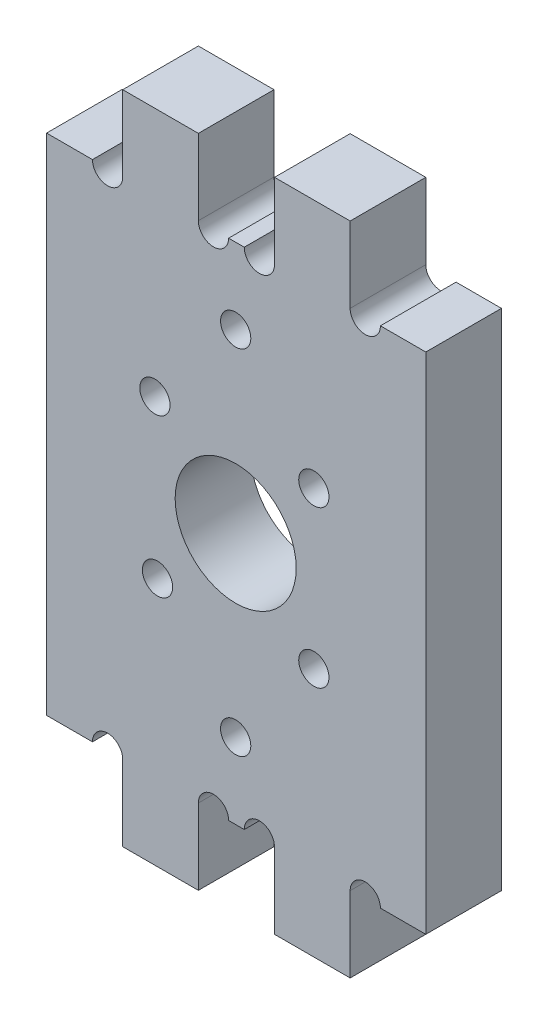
ISO-10303-21;
HEADER;
FILE_DESCRIPTION(('STEP AP214'),'2;1');
FILE_NAME('part.step','',(''),(''),'','','');
FILE_SCHEMA(('AUTOMOTIVE_DESIGN { 1 0 10303 214 1 1 1 1 }'));
ENDSEC;
DATA;
#1=APPLICATION_CONTEXT('core data for automotive mechanical design processes');
#2=APPLICATION_PROTOCOL_DEFINITION('international standard','automotive_design',2000,#1);
#3=PRODUCT_CONTEXT('',#1,'mechanical');
#4=PRODUCT('Part','Part','',(#3));
#5=PRODUCT_RELATED_PRODUCT_CATEGORY('part','',(#4));
#6=PRODUCT_DEFINITION_FORMATION('','',#4);
#7=PRODUCT_DEFINITION_CONTEXT('part definition',#1,'design');
#8=PRODUCT_DEFINITION('design','',#6,#7);
#9=PRODUCT_DEFINITION_SHAPE('','',#8);
#10=(LENGTH_UNIT() NAMED_UNIT(*) SI_UNIT(.MILLI.,.METRE.));
#11=(NAMED_UNIT(*) PLANE_ANGLE_UNIT() SI_UNIT($,.RADIAN.));
#12=(NAMED_UNIT(*) SI_UNIT($,.STERADIAN.) SOLID_ANGLE_UNIT());
#13=UNCERTAINTY_MEASURE_WITH_UNIT(LENGTH_MEASURE(1.E-05),#10,'distance_accuracy_value','');
#14=(GEOMETRIC_REPRESENTATION_CONTEXT(3) GLOBAL_UNCERTAINTY_ASSIGNED_CONTEXT((#13)) GLOBAL_UNIT_ASSIGNED_CONTEXT((#10,
#11,#12)) REPRESENTATION_CONTEXT('',''));
#15=CARTESIAN_POINT('',(0.,0.,0.));
#16=DIRECTION('',(0.,0.,1.));
#17=DIRECTION('',(1.,0.,0.));
#18=AXIS2_PLACEMENT_3D('',#15,#16,#17);
#19=CARTESIAN_POINT('',(0.,0.,15.));
#20=DIRECTION('',(0.,1.,0.));
#21=DIRECTION('',(-1.,0.,0.));
#22=AXIS2_PLACEMENT_3D('',#19,#20,#21);
#23=PLANE('',#22);
#24=DIRECTION('',(1.,0.,0.));
#25=VECTOR('',#24,1.);
#26=CARTESIAN_POINT('',(0.,0.,0.));
#27=LINE('',#26,#25);
#28=CARTESIAN_POINT('',(-8.99999999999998,0.,0.));
#29=VERTEX_POINT('',#28);
#30=CARTESIAN_POINT('',(0.,0.,0.));
#31=VERTEX_POINT('',#30);
#32=EDGE_CURVE('E255',#29,#31,#27,.T.);
#33=ORIENTED_EDGE('',*,*,#32,.T.);
#34=DIRECTION('',(0.,0.,-1.));
#35=VECTOR('',#34,1.);
#36=CARTESIAN_POINT('',(0.,0.,15.));
#37=LINE('',#36,#35);
#38=CARTESIAN_POINT('',(0.,0.,15.));
#39=VERTEX_POINT('',#38);
#40=EDGE_CURVE('E11',#39,#31,#37,.T.);
#41=ORIENTED_EDGE('',*,*,#40,.F.);
#42=DIRECTION('',(1.,0.,0.));
#43=VECTOR('',#42,1.);
#44=CARTESIAN_POINT('',(0.,0.,15.));
#45=LINE('',#44,#43);
#46=CARTESIAN_POINT('',(-8.99999999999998,0.,15.));
#47=VERTEX_POINT('',#46);
#48=EDGE_CURVE('E310',#47,#39,#45,.T.);
#49=ORIENTED_EDGE('',*,*,#48,.F.);
#50=DIRECTION('',(0.,0.,-1.));
#51=VECTOR('',#50,1.);
#52=CARTESIAN_POINT('',(-8.99999999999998,0.,15.));
#53=LINE('',#52,#51);
#54=EDGE_CURVE('E251',#47,#29,#53,.T.);
#55=ORIENTED_EDGE('',*,*,#54,.T.);
#56=EDGE_LOOP('',(#33,#41,#49,#55));
#57=FACE_BOUND('',#56,.T.);
#58=ADVANCED_FACE('F37',(#57),#23,.F.);
#59=CARTESIAN_POINT('',(0.,0.,15.));
#60=DIRECTION('',(-1.,0.,0.));
#61=DIRECTION('',(0.,0.,1.));
#62=AXIS2_PLACEMENT_3D('',#59,#60,#61);
#63=PLANE('',#62);
#64=DIRECTION('',(0.,1.,0.));
#65=VECTOR('',#64,1.);
#66=CARTESIAN_POINT('',(0.,0.,0.));
#67=LINE('',#66,#65);
#68=CARTESIAN_POINT('',(0.,100.,0.));
#69=VERTEX_POINT('',#68);
#70=EDGE_CURVE('E258',#31,#69,#67,.T.);
#71=ORIENTED_EDGE('',*,*,#70,.T.);
#72=DIRECTION('',(0.,0.,-1.));
#73=VECTOR('',#72,1.);
#74=CARTESIAN_POINT('',(0.,100.,15.));
#75=LINE('',#74,#73);
#76=CARTESIAN_POINT('',(0.,100.,15.));
#77=VERTEX_POINT('',#76);
#78=EDGE_CURVE('E46',#77,#69,#75,.T.);
#79=ORIENTED_EDGE('',*,*,#78,.F.);
#80=DIRECTION('',(0.,1.,0.));
#81=VECTOR('',#80,1.);
#82=CARTESIAN_POINT('',(0.,0.,15.));
#83=LINE('',#82,#81);
#84=EDGE_CURVE('E158',#39,#77,#83,.T.);
#85=ORIENTED_EDGE('',*,*,#84,.F.);
#86=ORIENTED_EDGE('',*,*,#40,.T.);
#87=EDGE_LOOP('',(#71,#79,#85,#86));
#88=FACE_BOUND('',#87,.T.);
#89=ADVANCED_FACE('F510',(#88),#63,.F.);
#90=CARTESIAN_POINT('',(0.,100.,15.));
#91=DIRECTION('',(0.,-1.,0.));
#92=DIRECTION('',(0.,0.,-1.));
#93=AXIS2_PLACEMENT_3D('',#90,#91,#92);
#94=PLANE('',#93);
#95=DIRECTION('',(-1.,0.,0.));
#96=VECTOR('',#95,1.);
#97=CARTESIAN_POINT('',(0.,100.,0.));
#98=LINE('',#97,#96);
#99=CARTESIAN_POINT('',(-9.,100.,0.));
#100=VERTEX_POINT('',#99);
#101=EDGE_CURVE('E261',#69,#100,#98,.T.);
#102=ORIENTED_EDGE('',*,*,#101,.T.);
#103=DIRECTION('',(0.,0.,-1.));
#104=VECTOR('',#103,1.);
#105=CARTESIAN_POINT('',(-9.,100.,15.));
#106=LINE('',#105,#104);
#107=CARTESIAN_POINT('',(-9.,100.,15.));
#108=VERTEX_POINT('',#107);
#109=EDGE_CURVE('E377',#108,#100,#106,.T.);
#110=ORIENTED_EDGE('',*,*,#109,.F.);
#111=DIRECTION('',(-1.,0.,0.));
#112=VECTOR('',#111,1.);
#113=CARTESIAN_POINT('',(0.,100.,15.));
#114=LINE('',#113,#112);
#115=EDGE_CURVE('E438',#77,#108,#114,.T.);
#116=ORIENTED_EDGE('',*,*,#115,.F.);
#117=ORIENTED_EDGE('',*,*,#78,.T.);
#118=EDGE_LOOP('',(#102,#110,#116,#117));
#119=FACE_BOUND('',#118,.T.);
#120=ADVANCED_FACE('F514',(#119),#94,.F.);
#121=CARTESIAN_POINT('',(-12.,100.,15.));
#122=DIRECTION('',(0.,0.,-1.));
#123=DIRECTION('',(-1.,0.,0.));
#124=AXIS2_PLACEMENT_3D('',#121,#122,#123);
#125=CYLINDRICAL_SURFACE('',#124,3.);
#126=CARTESIAN_POINT('',(-12.,100.,0.));
#127=DIRECTION('',(0.,0.,-1.));
#128=DIRECTION('',(-1.,0.,0.));
#129=AXIS2_PLACEMENT_3D('',#126,#127,#128);
#130=CIRCLE('',#129,3.);
#131=CARTESIAN_POINT('',(-15.,100.,0.));
#132=VERTEX_POINT('',#131);
#133=EDGE_CURVE('E263',#100,#132,#130,.T.);
#134=ORIENTED_EDGE('',*,*,#133,.T.);
#135=DIRECTION('',(0.,0.,-1.));
#136=VECTOR('',#135,1.);
#137=CARTESIAN_POINT('',(-15.,100.,15.));
#138=LINE('',#137,#136);
#139=CARTESIAN_POINT('',(-15.,100.,15.));
#140=VERTEX_POINT('',#139);
#141=EDGE_CURVE('E374',#140,#132,#138,.T.);
#142=ORIENTED_EDGE('',*,*,#141,.F.);
#143=CARTESIAN_POINT('',(-12.,100.,15.));
#144=DIRECTION('',(0.,0.,-1.));
#145=DIRECTION('',(-1.,0.,0.));
#146=AXIS2_PLACEMENT_3D('',#143,#144,#145);
#147=CIRCLE('',#146,3.);
#148=EDGE_CURVE('E440',#108,#140,#147,.T.);
#149=ORIENTED_EDGE('',*,*,#148,.F.);
#150=ORIENTED_EDGE('',*,*,#109,.T.);
#151=EDGE_LOOP('',(#134,#142,#149,#150));
#152=FACE_BOUND('',#151,.T.);
#153=ADVANCED_FACE('F518',(#152),#125,.F.);
#154=CARTESIAN_POINT('',(-15.,100.,15.));
#155=DIRECTION('',(-1.,0.,0.));
#156=DIRECTION('',(0.,-1.,0.));
#157=AXIS2_PLACEMENT_3D('',#154,#155,#156);
#158=PLANE('',#157);
#159=DIRECTION('',(0.,1.,0.));
#160=VECTOR('',#159,1.);
#161=CARTESIAN_POINT('',(-15.,100.,0.));
#162=LINE('',#161,#160);
#163=CARTESIAN_POINT('',(-15.,115.,0.));
#164=VERTEX_POINT('',#163);
#165=EDGE_CURVE('E265',#132,#164,#162,.T.);
#166=ORIENTED_EDGE('',*,*,#165,.T.);
#167=DIRECTION('',(0.,0.,-1.));
#168=VECTOR('',#167,1.);
#169=CARTESIAN_POINT('',(-15.,115.,15.));
#170=LINE('',#169,#168);
#171=CARTESIAN_POINT('',(-15.,115.,15.));
#172=VERTEX_POINT('',#171);
#173=EDGE_CURVE('E371',#172,#164,#170,.T.);
#174=ORIENTED_EDGE('',*,*,#173,.F.);
#175=DIRECTION('',(0.,1.,0.));
#176=VECTOR('',#175,1.);
#177=CARTESIAN_POINT('',(-15.,100.,15.));
#178=LINE('',#177,#176);
#179=EDGE_CURVE('E442',#140,#172,#178,.T.);
#180=ORIENTED_EDGE('',*,*,#179,.F.);
#181=ORIENTED_EDGE('',*,*,#141,.T.);
#182=EDGE_LOOP('',(#166,#174,#180,#181));
#183=FACE_BOUND('',#182,.T.);
#184=ADVANCED_FACE('F524',(#183),#158,.F.);
#185=CARTESIAN_POINT('',(-15.,115.,15.));
#186=DIRECTION('',(0.,-1.,0.));
#187=DIRECTION('',(0.,0.,-1.));
#188=AXIS2_PLACEMENT_3D('',#185,#186,#187);
#189=PLANE('',#188);
#190=DIRECTION('',(-1.,0.,0.));
#191=VECTOR('',#190,1.);
#192=CARTESIAN_POINT('',(-15.,115.,0.));
#193=LINE('',#192,#191);
#194=CARTESIAN_POINT('',(-30.,115.,0.));
#195=VERTEX_POINT('',#194);
#196=EDGE_CURVE('E267',#164,#195,#193,.T.);
#197=ORIENTED_EDGE('',*,*,#196,.T.);
#198=DIRECTION('',(0.,0.,-1.));
#199=VECTOR('',#198,1.);
#200=CARTESIAN_POINT('',(-30.,115.,15.));
#201=LINE('',#200,#199);
#202=CARTESIAN_POINT('',(-30.,115.,15.));
#203=VERTEX_POINT('',#202);
#204=EDGE_CURVE('E368',#203,#195,#201,.T.);
#205=ORIENTED_EDGE('',*,*,#204,.F.);
#206=DIRECTION('',(-1.,0.,0.));
#207=VECTOR('',#206,1.);
#208=CARTESIAN_POINT('',(-15.,115.,15.));
#209=LINE('',#208,#207);
#210=EDGE_CURVE('E444',#172,#203,#209,.T.);
#211=ORIENTED_EDGE('',*,*,#210,.F.);
#212=ORIENTED_EDGE('',*,*,#173,.T.);
#213=EDGE_LOOP('',(#197,#205,#211,#212));
#214=FACE_BOUND('',#213,.T.);
#215=ADVANCED_FACE('F528',(#214),#189,.F.);
#216=CARTESIAN_POINT('',(-30.,115.,15.));
#217=DIRECTION('',(1.,0.,0.));
#218=DIRECTION('',(0.,1.,0.));
#219=AXIS2_PLACEMENT_3D('',#216,#217,#218);
#220=PLANE('',#219);
#221=DIRECTION('',(0.,-1.,0.));
#222=VECTOR('',#221,1.);
#223=CARTESIAN_POINT('',(-30.,115.,0.));
#224=LINE('',#223,#222);
#225=CARTESIAN_POINT('',(-30.,100.,0.));
#226=VERTEX_POINT('',#225);
#227=EDGE_CURVE('E269',#195,#226,#224,.T.);
#228=ORIENTED_EDGE('',*,*,#227,.T.);
#229=DIRECTION('',(0.,0.,-1.));
#230=VECTOR('',#229,1.);
#231=CARTESIAN_POINT('',(-30.,100.,15.));
#232=LINE('',#231,#230);
#233=CARTESIAN_POINT('',(-30.,100.,15.));
#234=VERTEX_POINT('',#233);
#235=EDGE_CURVE('E365',#234,#226,#232,.T.);
#236=ORIENTED_EDGE('',*,*,#235,.F.);
#237=DIRECTION('',(0.,-1.,0.));
#238=VECTOR('',#237,1.);
#239=CARTESIAN_POINT('',(-30.,115.,15.));
#240=LINE('',#239,#238);
#241=EDGE_CURVE('E446',#203,#234,#240,.T.);
#242=ORIENTED_EDGE('',*,*,#241,.F.);
#243=ORIENTED_EDGE('',*,*,#204,.T.);
#244=EDGE_LOOP('',(#228,#236,#242,#243));
#245=FACE_BOUND('',#244,.T.);
#246=ADVANCED_FACE('F532',(#245),#220,.F.);
#247=CARTESIAN_POINT('',(-33.,100.,15.));
#248=DIRECTION('',(0.,0.,-1.));
#249=DIRECTION('',(-1.,0.,0.));
#250=AXIS2_PLACEMENT_3D('',#247,#248,#249);
#251=CYLINDRICAL_SURFACE('',#250,3.);
#252=CARTESIAN_POINT('',(-33.,100.,0.));
#253=DIRECTION('',(0.,0.,-1.));
#254=DIRECTION('',(-1.,0.,0.));
#255=AXIS2_PLACEMENT_3D('',#252,#253,#254);
#256=CIRCLE('',#255,3.);
#257=CARTESIAN_POINT('',(-36.,100.,0.));
#258=VERTEX_POINT('',#257);
#259=EDGE_CURVE('E271',#226,#258,#256,.T.);
#260=ORIENTED_EDGE('',*,*,#259,.T.);
#261=DIRECTION('',(0.,0.,-1.));
#262=VECTOR('',#261,1.);
#263=CARTESIAN_POINT('',(-36.,100.,15.));
#264=LINE('',#263,#262);
#265=CARTESIAN_POINT('',(-36.,100.,15.));
#266=VERTEX_POINT('',#265);
#267=EDGE_CURVE('E362',#266,#258,#264,.T.);
#268=ORIENTED_EDGE('',*,*,#267,.F.);
#269=CARTESIAN_POINT('',(-33.,100.,15.));
#270=DIRECTION('',(0.,0.,-1.));
#271=DIRECTION('',(-1.,0.,0.));
#272=AXIS2_PLACEMENT_3D('',#269,#270,#271);
#273=CIRCLE('',#272,3.);
#274=EDGE_CURVE('E448',#234,#266,#273,.T.);
#275=ORIENTED_EDGE('',*,*,#274,.F.);
#276=ORIENTED_EDGE('',*,*,#235,.T.);
#277=EDGE_LOOP('',(#260,#268,#275,#276));
#278=FACE_BOUND('',#277,.T.);
#279=ADVANCED_FACE('F536',(#278),#251,.F.);
#280=CARTESIAN_POINT('',(-36.,100.,15.));
#281=DIRECTION('',(0.,-1.,0.));
#282=DIRECTION('',(0.,0.,-1.));
#283=AXIS2_PLACEMENT_3D('',#280,#281,#282);
#284=PLANE('',#283);
#285=DIRECTION('',(-1.,0.,0.));
#286=VECTOR('',#285,1.);
#287=CARTESIAN_POINT('',(-36.,100.,0.));
#288=LINE('',#287,#286);
#289=CARTESIAN_POINT('',(-39.1,100.,0.));
#290=VERTEX_POINT('',#289);
#291=EDGE_CURVE('E273',#258,#290,#288,.T.);
#292=ORIENTED_EDGE('',*,*,#291,.T.);
#293=DIRECTION('',(0.,0.,-1.));
#294=VECTOR('',#293,1.);
#295=CARTESIAN_POINT('',(-39.1,100.,15.));
#296=LINE('',#295,#294);
#297=CARTESIAN_POINT('',(-39.1,100.,15.));
#298=VERTEX_POINT('',#297);
#299=EDGE_CURVE('E359',#298,#290,#296,.T.);
#300=ORIENTED_EDGE('',*,*,#299,.F.);
#301=DIRECTION('',(-1.,0.,0.));
#302=VECTOR('',#301,1.);
#303=CARTESIAN_POINT('',(-36.,100.,15.));
#304=LINE('',#303,#302);
#305=EDGE_CURVE('E450',#266,#298,#304,.T.);
#306=ORIENTED_EDGE('',*,*,#305,.F.);
#307=ORIENTED_EDGE('',*,*,#267,.T.);
#308=EDGE_LOOP('',(#292,#300,#306,#307));
#309=FACE_BOUND('',#308,.T.);
#310=ADVANCED_FACE('F540',(#309),#284,.F.);
#311=CARTESIAN_POINT('',(-42.1,100.,15.));
#312=DIRECTION('',(0.,0.,-1.));
#313=DIRECTION('',(-1.,0.,0.));
#314=AXIS2_PLACEMENT_3D('',#311,#312,#313);
#315=CYLINDRICAL_SURFACE('',#314,2.99999999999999);
#316=CARTESIAN_POINT('',(-42.1,100.,0.));
#317=DIRECTION('',(0.,0.,-1.));
#318=DIRECTION('',(-1.,0.,0.));
#319=AXIS2_PLACEMENT_3D('',#316,#317,#318);
#320=CIRCLE('',#319,2.99999999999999);
#321=CARTESIAN_POINT('',(-45.1,100.,0.));
#322=VERTEX_POINT('',#321);
#323=EDGE_CURVE('E275',#290,#322,#320,.T.);
#324=ORIENTED_EDGE('',*,*,#323,.T.);
#325=DIRECTION('',(0.,0.,-1.));
#326=VECTOR('',#325,1.);
#327=CARTESIAN_POINT('',(-45.1,100.,15.));
#328=LINE('',#327,#326);
#329=CARTESIAN_POINT('',(-45.1,100.,15.));
#330=VERTEX_POINT('',#329);
#331=EDGE_CURVE('E356',#330,#322,#328,.T.);
#332=ORIENTED_EDGE('',*,*,#331,.F.);
#333=CARTESIAN_POINT('',(-42.1,100.,15.));
#334=DIRECTION('',(0.,0.,-1.));
#335=DIRECTION('',(-1.,0.,0.));
#336=AXIS2_PLACEMENT_3D('',#333,#334,#335);
#337=CIRCLE('',#336,2.99999999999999);
#338=EDGE_CURVE('E452',#298,#330,#337,.T.);
#339=ORIENTED_EDGE('',*,*,#338,.F.);
#340=ORIENTED_EDGE('',*,*,#299,.T.);
#341=EDGE_LOOP('',(#324,#332,#339,#340));
#342=FACE_BOUND('',#341,.T.);
#343=ADVANCED_FACE('F544',(#342),#315,.F.);
#344=CARTESIAN_POINT('',(-45.1,100.,15.));
#345=DIRECTION('',(-1.,0.,0.));
#346=DIRECTION('',(0.,-1.,0.));
#347=AXIS2_PLACEMENT_3D('',#344,#345,#346);
#348=PLANE('',#347);
#349=DIRECTION('',(0.,1.,0.));
#350=VECTOR('',#349,1.);
#351=CARTESIAN_POINT('',(-45.1,100.,0.));
#352=LINE('',#351,#350);
#353=CARTESIAN_POINT('',(-45.1,115.,0.));
#354=VERTEX_POINT('',#353);
#355=EDGE_CURVE('E277',#322,#354,#352,.T.);
#356=ORIENTED_EDGE('',*,*,#355,.T.);
#357=DIRECTION('',(0.,0.,-1.));
#358=VECTOR('',#357,1.);
#359=CARTESIAN_POINT('',(-45.1,115.,15.));
#360=LINE('',#359,#358);
#361=CARTESIAN_POINT('',(-45.1,115.,15.));
#362=VERTEX_POINT('',#361);
#363=EDGE_CURVE('E353',#362,#354,#360,.T.);
#364=ORIENTED_EDGE('',*,*,#363,.F.);
#365=DIRECTION('',(0.,1.,0.));
#366=VECTOR('',#365,1.);
#367=CARTESIAN_POINT('',(-45.1,100.,15.));
#368=LINE('',#367,#366);
#369=EDGE_CURVE('E454',#330,#362,#368,.T.);
#370=ORIENTED_EDGE('',*,*,#369,.F.);
#371=ORIENTED_EDGE('',*,*,#331,.T.);
#372=EDGE_LOOP('',(#356,#364,#370,#371));
#373=FACE_BOUND('',#372,.T.);
#374=ADVANCED_FACE('F548',(#373),#348,.F.);
#375=CARTESIAN_POINT('',(-45.1,115.,15.));
#376=DIRECTION('',(0.,-1.,0.));
#377=DIRECTION('',(0.,0.,-1.));
#378=AXIS2_PLACEMENT_3D('',#375,#376,#377);
#379=PLANE('',#378);
#380=DIRECTION('',(-1.,0.,0.));
#381=VECTOR('',#380,1.);
#382=CARTESIAN_POINT('',(-45.1,115.,0.));
#383=LINE('',#382,#381);
#384=CARTESIAN_POINT('',(-60.1,115.,0.));
#385=VERTEX_POINT('',#384);
#386=EDGE_CURVE('E279',#354,#385,#383,.T.);
#387=ORIENTED_EDGE('',*,*,#386,.T.);
#388=DIRECTION('',(0.,0.,-1.));
#389=VECTOR('',#388,1.);
#390=CARTESIAN_POINT('',(-60.1,115.,15.));
#391=LINE('',#390,#389);
#392=CARTESIAN_POINT('',(-60.1,115.,15.));
#393=VERTEX_POINT('',#392);
#394=EDGE_CURVE('E350',#393,#385,#391,.T.);
#395=ORIENTED_EDGE('',*,*,#394,.F.);
#396=DIRECTION('',(-1.,0.,0.));
#397=VECTOR('',#396,1.);
#398=CARTESIAN_POINT('',(-45.1,115.,15.));
#399=LINE('',#398,#397);
#400=EDGE_CURVE('E456',#362,#393,#399,.T.);
#401=ORIENTED_EDGE('',*,*,#400,.F.);
#402=ORIENTED_EDGE('',*,*,#363,.T.);
#403=EDGE_LOOP('',(#387,#395,#401,#402));
#404=FACE_BOUND('',#403,.T.);
#405=ADVANCED_FACE('F552',(#404),#379,.F.);
#406=CARTESIAN_POINT('',(-60.1,115.,15.));
#407=DIRECTION('',(1.,0.,0.));
#408=DIRECTION('',(0.,1.,0.));
#409=AXIS2_PLACEMENT_3D('',#406,#407,#408);
#410=PLANE('',#409);
#411=DIRECTION('',(0.,-1.,0.));
#412=VECTOR('',#411,1.);
#413=CARTESIAN_POINT('',(-60.1,115.,0.));
#414=LINE('',#413,#412);
#415=CARTESIAN_POINT('',(-60.1,100.,0.));
#416=VERTEX_POINT('',#415);
#417=EDGE_CURVE('E281',#385,#416,#414,.T.);
#418=ORIENTED_EDGE('',*,*,#417,.T.);
#419=DIRECTION('',(0.,0.,-1.));
#420=VECTOR('',#419,1.);
#421=CARTESIAN_POINT('',(-60.1,100.,15.));
#422=LINE('',#421,#420);
#423=CARTESIAN_POINT('',(-60.1,100.,15.));
#424=VERTEX_POINT('',#423);
#425=EDGE_CURVE('E347',#424,#416,#422,.T.);
#426=ORIENTED_EDGE('',*,*,#425,.F.);
#427=DIRECTION('',(0.,-1.,0.));
#428=VECTOR('',#427,1.);
#429=CARTESIAN_POINT('',(-60.1,115.,15.));
#430=LINE('',#429,#428);
#431=EDGE_CURVE('E458',#393,#424,#430,.T.);
#432=ORIENTED_EDGE('',*,*,#431,.F.);
#433=ORIENTED_EDGE('',*,*,#394,.T.);
#434=EDGE_LOOP('',(#418,#426,#432,#433));
#435=FACE_BOUND('',#434,.T.);
#436=ADVANCED_FACE('F556',(#435),#410,.F.);
#437=CARTESIAN_POINT('',(-63.1,100.,15.));
#438=DIRECTION('',(0.,0.,-1.));
#439=DIRECTION('',(-1.,0.,0.));
#440=AXIS2_PLACEMENT_3D('',#437,#438,#439);
#441=CYLINDRICAL_SURFACE('',#440,3.);
#442=CARTESIAN_POINT('',(-63.1,100.,0.));
#443=DIRECTION('',(0.,0.,-1.));
#444=DIRECTION('',(-1.,0.,0.));
#445=AXIS2_PLACEMENT_3D('',#442,#443,#444);
#446=CIRCLE('',#445,3.);
#447=CARTESIAN_POINT('',(-66.1,100.,0.));
#448=VERTEX_POINT('',#447);
#449=EDGE_CURVE('E283',#416,#448,#446,.T.);
#450=ORIENTED_EDGE('',*,*,#449,.T.);
#451=DIRECTION('',(0.,0.,-1.));
#452=VECTOR('',#451,1.);
#453=CARTESIAN_POINT('',(-66.1,100.,15.));
#454=LINE('',#453,#452);
#455=CARTESIAN_POINT('',(-66.1,100.,15.));
#456=VERTEX_POINT('',#455);
#457=EDGE_CURVE('E344',#456,#448,#454,.T.);
#458=ORIENTED_EDGE('',*,*,#457,.F.);
#459=CARTESIAN_POINT('',(-63.1,100.,15.));
#460=DIRECTION('',(0.,0.,-1.));
#461=DIRECTION('',(-1.,0.,0.));
#462=AXIS2_PLACEMENT_3D('',#459,#460,#461);
#463=CIRCLE('',#462,3.);
#464=EDGE_CURVE('E460',#424,#456,#463,.T.);
#465=ORIENTED_EDGE('',*,*,#464,.F.);
#466=ORIENTED_EDGE('',*,*,#425,.T.);
#467=EDGE_LOOP('',(#450,#458,#465,#466));
#468=FACE_BOUND('',#467,.T.);
#469=ADVANCED_FACE('F560',(#468),#441,.F.);
#470=CARTESIAN_POINT('',(-66.1,100.,15.));
#471=DIRECTION('',(0.,-1.,0.));
#472=DIRECTION('',(1.,0.,0.));
#473=AXIS2_PLACEMENT_3D('',#470,#471,#472);
#474=PLANE('',#473);
#475=DIRECTION('',(-1.,0.,0.));
#476=VECTOR('',#475,1.);
#477=CARTESIAN_POINT('',(-66.1,100.,0.));
#478=LINE('',#477,#476);
#479=CARTESIAN_POINT('',(-75.2,100.,0.));
#480=VERTEX_POINT('',#479);
#481=EDGE_CURVE('E285',#448,#480,#478,.T.);
#482=ORIENTED_EDGE('',*,*,#481,.T.);
#483=DIRECTION('',(0.,0.,-1.));
#484=VECTOR('',#483,1.);
#485=CARTESIAN_POINT('',(-75.2,100.,15.));
#486=LINE('',#485,#484);
#487=CARTESIAN_POINT('',(-75.2,100.,15.));
#488=VERTEX_POINT('',#487);
#489=EDGE_CURVE('E341',#488,#480,#486,.T.);
#490=ORIENTED_EDGE('',*,*,#489,.F.);
#491=DIRECTION('',(-1.,0.,0.));
#492=VECTOR('',#491,1.);
#493=CARTESIAN_POINT('',(-66.1,100.,15.));
#494=LINE('',#493,#492);
#495=EDGE_CURVE('E462',#456,#488,#494,.T.);
#496=ORIENTED_EDGE('',*,*,#495,.F.);
#497=ORIENTED_EDGE('',*,*,#457,.T.);
#498=EDGE_LOOP('',(#482,#490,#496,#497));
#499=FACE_BOUND('',#498,.T.);
#500=ADVANCED_FACE('F564',(#499),#474,.F.);
#501=CARTESIAN_POINT('',(-75.2,100.,15.));
#502=DIRECTION('',(1.,0.,0.));
#503=DIRECTION('',(0.,1.,0.));
#504=AXIS2_PLACEMENT_3D('',#501,#502,#503);
#505=PLANE('',#504);
#506=DIRECTION('',(0.,-1.,0.));
#507=VECTOR('',#506,1.);
#508=CARTESIAN_POINT('',(-75.2,100.,0.));
#509=LINE('',#508,#507);
#510=CARTESIAN_POINT('',(-75.2,0.,0.));
#511=VERTEX_POINT('',#510);
#512=EDGE_CURVE('E287',#480,#511,#509,.T.);
#513=ORIENTED_EDGE('',*,*,#512,.T.);
#514=DIRECTION('',(0.,0.,-1.));
#515=VECTOR('',#514,1.);
#516=CARTESIAN_POINT('',(-75.2,0.,15.));
#517=LINE('',#516,#515);
#518=CARTESIAN_POINT('',(-75.2,0.,15.));
#519=VERTEX_POINT('',#518);
#520=EDGE_CURVE('E338',#519,#511,#517,.T.);
#521=ORIENTED_EDGE('',*,*,#520,.F.);
#522=DIRECTION('',(0.,-1.,0.));
#523=VECTOR('',#522,1.);
#524=CARTESIAN_POINT('',(-75.2,100.,15.));
#525=LINE('',#524,#523);
#526=EDGE_CURVE('E464',#488,#519,#525,.T.);
#527=ORIENTED_EDGE('',*,*,#526,.F.);
#528=ORIENTED_EDGE('',*,*,#489,.T.);
#529=EDGE_LOOP('',(#513,#521,#527,#528));
#530=FACE_BOUND('',#529,.T.);
#531=ADVANCED_FACE('F568',(#530),#505,.F.);
#532=CARTESIAN_POINT('',(-75.2,0.,15.));
#533=DIRECTION('',(0.,1.,0.));
#534=DIRECTION('',(0.,0.,1.));
#535=AXIS2_PLACEMENT_3D('',#532,#533,#534);
#536=PLANE('',#535);
#537=DIRECTION('',(1.,0.,0.));
#538=VECTOR('',#537,1.);
#539=CARTESIAN_POINT('',(-75.2,0.,0.));
#540=LINE('',#539,#538);
#541=CARTESIAN_POINT('',(-66.1,0.,0.));
#542=VERTEX_POINT('',#541);
#543=EDGE_CURVE('E289',#511,#542,#540,.T.);
#544=ORIENTED_EDGE('',*,*,#543,.T.);
#545=DIRECTION('',(0.,0.,-1.));
#546=VECTOR('',#545,1.);
#547=CARTESIAN_POINT('',(-66.1,0.,15.));
#548=LINE('',#547,#546);
#549=CARTESIAN_POINT('',(-66.1,0.,15.));
#550=VERTEX_POINT('',#549);
#551=EDGE_CURVE('E335',#550,#542,#548,.T.);
#552=ORIENTED_EDGE('',*,*,#551,.F.);
#553=DIRECTION('',(1.,0.,0.));
#554=VECTOR('',#553,1.);
#555=CARTESIAN_POINT('',(-75.2,0.,15.));
#556=LINE('',#555,#554);
#557=EDGE_CURVE('E466',#519,#550,#556,.T.);
#558=ORIENTED_EDGE('',*,*,#557,.F.);
#559=ORIENTED_EDGE('',*,*,#520,.T.);
#560=EDGE_LOOP('',(#544,#552,#558,#559));
#561=FACE_BOUND('',#560,.T.);
#562=ADVANCED_FACE('F572',(#561),#536,.F.);
#563=CARTESIAN_POINT('',(-63.1,0.,15.));
#564=DIRECTION('',(0.,0.,-1.));
#565=DIRECTION('',(-1.,0.,0.));
#566=AXIS2_PLACEMENT_3D('',#563,#564,#565);
#567=CYLINDRICAL_SURFACE('',#566,3.);
#568=CARTESIAN_POINT('',(-63.1,0.,0.));
#569=DIRECTION('',(0.,0.,-1.));
#570=DIRECTION('',(1.,0.,0.));
#571=AXIS2_PLACEMENT_3D('',#568,#569,#570);
#572=CIRCLE('',#571,3.);
#573=CARTESIAN_POINT('',(-60.1,0.,0.));
#574=VERTEX_POINT('',#573);
#575=EDGE_CURVE('E291',#542,#574,#572,.T.);
#576=ORIENTED_EDGE('',*,*,#575,.T.);
#577=DIRECTION('',(0.,0.,-1.));
#578=VECTOR('',#577,1.);
#579=CARTESIAN_POINT('',(-60.1,0.,15.));
#580=LINE('',#579,#578);
#581=CARTESIAN_POINT('',(-60.1,0.,15.));
#582=VERTEX_POINT('',#581);
#583=EDGE_CURVE('E332',#582,#574,#580,.T.);
#584=ORIENTED_EDGE('',*,*,#583,.F.);
#585=CARTESIAN_POINT('',(-63.1,0.,15.));
#586=DIRECTION('',(0.,0.,-1.));
#587=DIRECTION('',(1.,0.,0.));
#588=AXIS2_PLACEMENT_3D('',#585,#586,#587);
#589=CIRCLE('',#588,3.);
#590=EDGE_CURVE('E468',#550,#582,#589,.T.);
#591=ORIENTED_EDGE('',*,*,#590,.F.);
#592=ORIENTED_EDGE('',*,*,#551,.T.);
#593=EDGE_LOOP('',(#576,#584,#591,#592));
#594=FACE_BOUND('',#593,.T.);
#595=ADVANCED_FACE('F576',(#594),#567,.F.);
#596=CARTESIAN_POINT('',(-60.1,0.,15.));
#597=DIRECTION('',(1.,0.,0.));
#598=DIRECTION('',(0.,1.,0.));
#599=AXIS2_PLACEMENT_3D('',#596,#597,#598);
#600=PLANE('',#599);
#601=DIRECTION('',(0.,-1.,0.));
#602=VECTOR('',#601,1.);
#603=CARTESIAN_POINT('',(-60.1,0.,0.));
#604=LINE('',#603,#602);
#605=CARTESIAN_POINT('',(-60.1,-15.,0.));
#606=VERTEX_POINT('',#605);
#607=EDGE_CURVE('E293',#574,#606,#604,.T.);
#608=ORIENTED_EDGE('',*,*,#607,.T.);
#609=DIRECTION('',(0.,0.,-1.));
#610=VECTOR('',#609,1.);
#611=CARTESIAN_POINT('',(-60.1,-15.,15.));
#612=LINE('',#611,#610);
#613=CARTESIAN_POINT('',(-60.1,-15.,15.));
#614=VERTEX_POINT('',#613);
#615=EDGE_CURVE('E329',#614,#606,#612,.T.);
#616=ORIENTED_EDGE('',*,*,#615,.F.);
#617=DIRECTION('',(0.,-1.,0.));
#618=VECTOR('',#617,1.);
#619=CARTESIAN_POINT('',(-60.1,0.,15.));
#620=LINE('',#619,#618);
#621=EDGE_CURVE('E470',#582,#614,#620,.T.);
#622=ORIENTED_EDGE('',*,*,#621,.F.);
#623=ORIENTED_EDGE('',*,*,#583,.T.);
#624=EDGE_LOOP('',(#608,#616,#622,#623));
#625=FACE_BOUND('',#624,.T.);
#626=ADVANCED_FACE('F580',(#625),#600,.F.);
#627=CARTESIAN_POINT('',(-60.1,-15.,15.));
#628=DIRECTION('',(0.,1.,0.));
#629=DIRECTION('',(0.,0.,1.));
#630=AXIS2_PLACEMENT_3D('',#627,#628,#629);
#631=PLANE('',#630);
#632=DIRECTION('',(1.,0.,0.));
#633=VECTOR('',#632,1.);
#634=CARTESIAN_POINT('',(-60.1,-15.,0.));
#635=LINE('',#634,#633);
#636=CARTESIAN_POINT('',(-45.1,-15.,0.));
#637=VERTEX_POINT('',#636);
#638=EDGE_CURVE('E295',#606,#637,#635,.T.);
#639=ORIENTED_EDGE('',*,*,#638,.T.);
#640=DIRECTION('',(0.,0.,-1.));
#641=VECTOR('',#640,1.);
#642=CARTESIAN_POINT('',(-45.1,-15.,15.));
#643=LINE('',#642,#641);
#644=CARTESIAN_POINT('',(-45.1,-15.,15.));
#645=VERTEX_POINT('',#644);
#646=EDGE_CURVE('E326',#645,#637,#643,.T.);
#647=ORIENTED_EDGE('',*,*,#646,.F.);
#648=DIRECTION('',(1.,0.,0.));
#649=VECTOR('',#648,1.);
#650=CARTESIAN_POINT('',(-60.1,-15.,15.));
#651=LINE('',#650,#649);
#652=EDGE_CURVE('E472',#614,#645,#651,.T.);
#653=ORIENTED_EDGE('',*,*,#652,.F.);
#654=ORIENTED_EDGE('',*,*,#615,.T.);
#655=EDGE_LOOP('',(#639,#647,#653,#654));
#656=FACE_BOUND('',#655,.T.);
#657=ADVANCED_FACE('F584',(#656),#631,.F.);
#658=CARTESIAN_POINT('',(-45.1,-15.,15.));
#659=DIRECTION('',(-1.,0.,0.));
#660=DIRECTION('',(0.,0.,1.));
#661=AXIS2_PLACEMENT_3D('',#658,#659,#660);
#662=PLANE('',#661);
#663=DIRECTION('',(0.,1.,0.));
#664=VECTOR('',#663,1.);
#665=CARTESIAN_POINT('',(-45.1,-15.,0.));
#666=LINE('',#665,#664);
#667=CARTESIAN_POINT('',(-45.1,0.,0.));
#668=VERTEX_POINT('',#667);
#669=EDGE_CURVE('E297',#637,#668,#666,.T.);
#670=ORIENTED_EDGE('',*,*,#669,.T.);
#671=DIRECTION('',(0.,0.,-1.));
#672=VECTOR('',#671,1.);
#673=CARTESIAN_POINT('',(-45.1,0.,15.));
#674=LINE('',#673,#672);
#675=CARTESIAN_POINT('',(-45.1,0.,15.));
#676=VERTEX_POINT('',#675);
#677=EDGE_CURVE('E323',#676,#668,#674,.T.);
#678=ORIENTED_EDGE('',*,*,#677,.F.);
#679=DIRECTION('',(0.,1.,0.));
#680=VECTOR('',#679,1.);
#681=CARTESIAN_POINT('',(-45.1,-15.,15.));
#682=LINE('',#681,#680);
#683=EDGE_CURVE('E474',#645,#676,#682,.T.);
#684=ORIENTED_EDGE('',*,*,#683,.F.);
#685=ORIENTED_EDGE('',*,*,#646,.T.);
#686=EDGE_LOOP('',(#670,#678,#684,#685));
#687=FACE_BOUND('',#686,.T.);
#688=ADVANCED_FACE('F588',(#687),#662,.F.);
#689=CARTESIAN_POINT('',(-42.1,0.,15.));
#690=DIRECTION('',(0.,0.,-1.));
#691=DIRECTION('',(-1.,0.,0.));
#692=AXIS2_PLACEMENT_3D('',#689,#690,#691);
#693=CYLINDRICAL_SURFACE('',#692,3.);
#694=CARTESIAN_POINT('',(-42.1,0.,0.));
#695=DIRECTION('',(0.,0.,-1.));
#696=DIRECTION('',(1.,0.,0.));
#697=AXIS2_PLACEMENT_3D('',#694,#695,#696);
#698=CIRCLE('',#697,3.);
#699=CARTESIAN_POINT('',(-39.1,0.,0.));
#700=VERTEX_POINT('',#699);
#701=EDGE_CURVE('E299',#668,#700,#698,.T.);
#702=ORIENTED_EDGE('',*,*,#701,.T.);
#703=DIRECTION('',(0.,0.,-1.));
#704=VECTOR('',#703,1.);
#705=CARTESIAN_POINT('',(-39.1,0.,15.));
#706=LINE('',#705,#704);
#707=CARTESIAN_POINT('',(-39.1,0.,15.));
#708=VERTEX_POINT('',#707);
#709=EDGE_CURVE('E320',#708,#700,#706,.T.);
#710=ORIENTED_EDGE('',*,*,#709,.F.);
#711=CARTESIAN_POINT('',(-42.1,0.,15.));
#712=DIRECTION('',(0.,0.,-1.));
#713=DIRECTION('',(1.,0.,0.));
#714=AXIS2_PLACEMENT_3D('',#711,#712,#713);
#715=CIRCLE('',#714,3.);
#716=EDGE_CURVE('E476',#676,#708,#715,.T.);
#717=ORIENTED_EDGE('',*,*,#716,.F.);
#718=ORIENTED_EDGE('',*,*,#677,.T.);
#719=EDGE_LOOP('',(#702,#710,#717,#718));
#720=FACE_BOUND('',#719,.T.);
#721=ADVANCED_FACE('F592',(#720),#693,.F.);
#722=CARTESIAN_POINT('',(-36.,0.,15.));
#723=DIRECTION('',(0.,1.,0.));
#724=DIRECTION('',(-1.,0.,0.));
#725=AXIS2_PLACEMENT_3D('',#722,#723,#724);
#726=PLANE('',#725);
#727=DIRECTION('',(1.,0.,0.));
#728=VECTOR('',#727,1.);
#729=CARTESIAN_POINT('',(-36.,0.,0.));
#730=LINE('',#729,#728);
#731=CARTESIAN_POINT('',(-36.,0.,0.));
#732=VERTEX_POINT('',#731);
#733=EDGE_CURVE('E301',#700,#732,#730,.T.);
#734=ORIENTED_EDGE('',*,*,#733,.T.);
#735=DIRECTION('',(0.,0.,-1.));
#736=VECTOR('',#735,1.);
#737=CARTESIAN_POINT('',(-36.,0.,15.));
#738=LINE('',#737,#736);
#739=CARTESIAN_POINT('',(-36.,0.,15.));
#740=VERTEX_POINT('',#739);
#741=EDGE_CURVE('E317',#740,#732,#738,.T.);
#742=ORIENTED_EDGE('',*,*,#741,.F.);
#743=DIRECTION('',(1.,0.,0.));
#744=VECTOR('',#743,1.);
#745=CARTESIAN_POINT('',(-36.,0.,15.));
#746=LINE('',#745,#744);
#747=EDGE_CURVE('E478',#708,#740,#746,.T.);
#748=ORIENTED_EDGE('',*,*,#747,.F.);
#749=ORIENTED_EDGE('',*,*,#709,.T.);
#750=EDGE_LOOP('',(#734,#742,#748,#749));
#751=FACE_BOUND('',#750,.T.);
#752=ADVANCED_FACE('F596',(#751),#726,.F.);
#753=CARTESIAN_POINT('',(-33.,0.,15.));
#754=DIRECTION('',(0.,0.,-1.));
#755=DIRECTION('',(-1.,0.,0.));
#756=AXIS2_PLACEMENT_3D('',#753,#754,#755);
#757=CYLINDRICAL_SURFACE('',#756,3.00000000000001);
#758=CARTESIAN_POINT('',(-33.,0.,0.));
#759=DIRECTION('',(0.,0.,-1.));
#760=DIRECTION('',(-1.,0.,0.));
#761=AXIS2_PLACEMENT_3D('',#758,#759,#760);
#762=CIRCLE('',#761,3.00000000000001);
#763=CARTESIAN_POINT('',(-30.,0.,0.));
#764=VERTEX_POINT('',#763);
#765=EDGE_CURVE('E303',#732,#764,#762,.T.);
#766=ORIENTED_EDGE('',*,*,#765,.T.);
#767=DIRECTION('',(0.,0.,-1.));
#768=VECTOR('',#767,1.);
#769=CARTESIAN_POINT('',(-30.,0.,15.));
#770=LINE('',#769,#768);
#771=CARTESIAN_POINT('',(-30.,0.,15.));
#772=VERTEX_POINT('',#771);
#773=EDGE_CURVE('E314',#772,#764,#770,.T.);
#774=ORIENTED_EDGE('',*,*,#773,.F.);
#775=CARTESIAN_POINT('',(-33.,0.,15.));
#776=DIRECTION('',(0.,0.,-1.));
#777=DIRECTION('',(-1.,0.,0.));
#778=AXIS2_PLACEMENT_3D('',#775,#776,#777);
#779=CIRCLE('',#778,3.00000000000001);
#780=EDGE_CURVE('E480',#740,#772,#779,.T.);
#781=ORIENTED_EDGE('',*,*,#780,.F.);
#782=ORIENTED_EDGE('',*,*,#741,.T.);
#783=EDGE_LOOP('',(#766,#774,#781,#782));
#784=FACE_BOUND('',#783,.T.);
#785=ADVANCED_FACE('F486',(#784),#757,.F.);
#786=CARTESIAN_POINT('',(-30.,0.,15.));
#787=DIRECTION('',(1.,0.,0.));
#788=DIRECTION('',(0.,1.,0.));
#789=AXIS2_PLACEMENT_3D('',#786,#787,#788);
#790=PLANE('',#789);
#791=DIRECTION('',(0.,-1.,0.));
#792=VECTOR('',#791,1.);
#793=CARTESIAN_POINT('',(-30.,0.,0.));
#794=LINE('',#793,#792);
#795=CARTESIAN_POINT('',(-30.,-15.,0.));
#796=VERTEX_POINT('',#795);
#797=EDGE_CURVE('E305',#764,#796,#794,.T.);
#798=ORIENTED_EDGE('',*,*,#797,.T.);
#799=DIRECTION('',(0.,0.,-1.));
#800=VECTOR('',#799,1.);
#801=CARTESIAN_POINT('',(-30.,-15.,15.));
#802=LINE('',#801,#800);
#803=CARTESIAN_POINT('',(-30.,-15.,15.));
#804=VERTEX_POINT('',#803);
#805=EDGE_CURVE('E246',#804,#796,#802,.T.);
#806=ORIENTED_EDGE('',*,*,#805,.F.);
#807=DIRECTION('',(0.,-1.,0.));
#808=VECTOR('',#807,1.);
#809=CARTESIAN_POINT('',(-30.,0.,15.));
#810=LINE('',#809,#808);
#811=EDGE_CURVE('E237',#772,#804,#810,.T.);
#812=ORIENTED_EDGE('',*,*,#811,.F.);
#813=ORIENTED_EDGE('',*,*,#773,.T.);
#814=EDGE_LOOP('',(#798,#806,#812,#813));
#815=FACE_BOUND('',#814,.T.);
#816=ADVANCED_FACE('F490',(#815),#790,.F.);
#817=CARTESIAN_POINT('',(-30.,-15.,15.));
#818=DIRECTION('',(0.,1.,0.));
#819=DIRECTION('',(0.,0.,1.));
#820=AXIS2_PLACEMENT_3D('',#817,#818,#819);
#821=PLANE('',#820);
#822=DIRECTION('',(1.,0.,0.));
#823=VECTOR('',#822,1.);
#824=CARTESIAN_POINT('',(-30.,-15.,0.));
#825=LINE('',#824,#823);
#826=CARTESIAN_POINT('',(-15.,-15.,0.));
#827=VERTEX_POINT('',#826);
#828=EDGE_CURVE('E245',#796,#827,#825,.T.);
#829=ORIENTED_EDGE('',*,*,#828,.T.);
#830=DIRECTION('',(0.,0.,-1.));
#831=VECTOR('',#830,1.);
#832=CARTESIAN_POINT('',(-15.,-15.,15.));
#833=LINE('',#832,#831);
#834=CARTESIAN_POINT('',(-15.,-15.,15.));
#835=VERTEX_POINT('',#834);
#836=EDGE_CURVE('E242',#835,#827,#833,.T.);
#837=ORIENTED_EDGE('',*,*,#836,.F.);
#838=DIRECTION('',(1.,0.,0.));
#839=VECTOR('',#838,1.);
#840=CARTESIAN_POINT('',(-30.,-15.,15.));
#841=LINE('',#840,#839);
#842=EDGE_CURVE('E231',#804,#835,#841,.T.);
#843=ORIENTED_EDGE('',*,*,#842,.F.);
#844=ORIENTED_EDGE('',*,*,#805,.T.);
#845=EDGE_LOOP('',(#829,#837,#843,#844));
#846=FACE_BOUND('',#845,.T.);
#847=ADVANCED_FACE('F243',(#846),#821,.F.);
#848=CARTESIAN_POINT('',(-15.,-15.,15.));
#849=DIRECTION('',(-1.,0.,0.));
#850=DIRECTION('',(0.,-1.,0.));
#851=AXIS2_PLACEMENT_3D('',#848,#849,#850);
#852=PLANE('',#851);
#853=DIRECTION('',(0.,1.,0.));
#854=VECTOR('',#853,1.);
#855=CARTESIAN_POINT('',(-15.,-15.,0.));
#856=LINE('',#855,#854);
#857=CARTESIAN_POINT('',(-15.,0.,0.));
#858=VERTEX_POINT('',#857);
#859=EDGE_CURVE('E144',#827,#858,#856,.T.);
#860=ORIENTED_EDGE('',*,*,#859,.T.);
#861=DIRECTION('',(0.,0.,-1.));
#862=VECTOR('',#861,1.);
#863=CARTESIAN_POINT('',(-15.,0.,15.));
#864=LINE('',#863,#862);
#865=CARTESIAN_POINT('',(-15.,0.,15.));
#866=VERTEX_POINT('',#865);
#867=EDGE_CURVE('E247',#866,#858,#864,.T.);
#868=ORIENTED_EDGE('',*,*,#867,.F.);
#869=DIRECTION('',(0.,1.,0.));
#870=VECTOR('',#869,1.);
#871=CARTESIAN_POINT('',(-15.,-15.,15.));
#872=LINE('',#871,#870);
#873=EDGE_CURVE('E235',#835,#866,#872,.T.);
#874=ORIENTED_EDGE('',*,*,#873,.F.);
#875=ORIENTED_EDGE('',*,*,#836,.T.);
#876=EDGE_LOOP('',(#860,#868,#874,#875));
#877=FACE_BOUND('',#876,.T.);
#878=ADVANCED_FACE('F249',(#877),#852,.F.);
#879=CARTESIAN_POINT('',(-12.,0.,15.));
#880=DIRECTION('',(0.,0.,-1.));
#881=DIRECTION('',(-1.,0.,0.));
#882=AXIS2_PLACEMENT_3D('',#879,#880,#881);
#883=CYLINDRICAL_SURFACE('',#882,3.);
#884=CARTESIAN_POINT('',(-12.,0.,0.));
#885=DIRECTION('',(0.,0.,-1.));
#886=DIRECTION('',(1.,0.,0.));
#887=AXIS2_PLACEMENT_3D('',#884,#885,#886);
#888=CIRCLE('',#887,3.);
#889=EDGE_CURVE('E150',#858,#29,#888,.T.);
#890=ORIENTED_EDGE('',*,*,#889,.T.);
#891=ORIENTED_EDGE('',*,*,#54,.F.);
#892=CARTESIAN_POINT('',(-12.,0.,15.));
#893=DIRECTION('',(0.,0.,-1.));
#894=DIRECTION('',(1.,0.,0.));
#895=AXIS2_PLACEMENT_3D('',#892,#893,#894);
#896=CIRCLE('',#895,3.);
#897=EDGE_CURVE('E55',#866,#47,#896,.T.);
#898=ORIENTED_EDGE('',*,*,#897,.F.);
#899=ORIENTED_EDGE('',*,*,#867,.T.);
#900=EDGE_LOOP('',(#890,#891,#898,#899));
#901=FACE_BOUND('',#900,.T.);
#902=ADVANCED_FACE('F498',(#901),#883,.F.);
#903=CARTESIAN_POINT('',(-12.,0.,15.));
#904=DIRECTION('',(0.,0.,1.));
#905=DIRECTION('',(1.,0.,0.));
#906=AXIS2_PLACEMENT_3D('',#903,#904,#905);
#907=PLANE('',#906);
#908=CARTESIAN_POINT('',(-37.7,15.,15.));
#909=DIRECTION('',(0.,0.,1.));
#910=DIRECTION('',(1.,0.,0.));
#911=AXIS2_PLACEMENT_3D('',#908,#909,#910);
#912=CIRCLE('',#911,3.);
#913=CARTESIAN_POINT('',(-34.7,15.,15.));
#914=VERTEX_POINT('',#913);
#915=EDGE_CURVE('E384',#914,#914,#912,.T.);
#916=ORIENTED_EDGE('',*,*,#915,.F.);
#917=EDGE_LOOP('',(#916));
#918=FACE_BOUND('',#917,.T.);
#919=CARTESIAN_POINT('',(-37.7,85.,15.));
#920=DIRECTION('',(0.,0.,1.));
#921=DIRECTION('',(1.,0.,0.));
#922=AXIS2_PLACEMENT_3D('',#919,#920,#921);
#923=CIRCLE('',#922,3.);
#924=CARTESIAN_POINT('',(-34.7,85.,15.));
#925=VERTEX_POINT('',#924);
#926=EDGE_CURVE('E383',#925,#925,#923,.T.);
#927=ORIENTED_EDGE('',*,*,#926,.F.);
#928=EDGE_LOOP('',(#927));
#929=FACE_BOUND('',#928,.T.);
#930=CARTESIAN_POINT('',(-53.7114338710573,65.5,15.));
#931=DIRECTION('',(0.,0.,1.));
#932=DIRECTION('',(1.,0.,0.));
#933=AXIS2_PLACEMENT_3D('',#930,#931,#932);
#934=CIRCLE('',#933,3.);
#935=CARTESIAN_POINT('',(-50.7114338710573,65.5,15.));
#936=VERTEX_POINT('',#935);
#937=EDGE_CURVE('E398',#936,#936,#934,.T.);
#938=ORIENTED_EDGE('',*,*,#937,.F.);
#939=EDGE_LOOP('',(#938));
#940=FACE_BOUND('',#939,.T.);
#941=CARTESIAN_POINT('',(-53.2,34.5,15.));
#942=DIRECTION('',(0.,0.,1.));
#943=DIRECTION('',(1.,0.,0.));
#944=AXIS2_PLACEMENT_3D('',#941,#942,#943);
#945=CIRCLE('',#944,3.);
#946=CARTESIAN_POINT('',(-50.2,34.5,15.));
#947=VERTEX_POINT('',#946);
#948=EDGE_CURVE('E404',#947,#947,#945,.T.);
#949=ORIENTED_EDGE('',*,*,#948,.F.);
#950=EDGE_LOOP('',(#949));
#951=FACE_BOUND('',#950,.T.);
#952=CARTESIAN_POINT('',(-22.2,34.5,15.));
#953=DIRECTION('',(0.,0.,1.));
#954=DIRECTION('',(1.,0.,0.));
#955=AXIS2_PLACEMENT_3D('',#952,#953,#954);
#956=CIRCLE('',#955,3.);
#957=CARTESIAN_POINT('',(-19.2,34.5,15.));
#958=VERTEX_POINT('',#957);
#959=EDGE_CURVE('E410',#958,#958,#956,.T.);
#960=ORIENTED_EDGE('',*,*,#959,.F.);
#961=EDGE_LOOP('',(#960));
#962=FACE_BOUND('',#961,.T.);
#963=CARTESIAN_POINT('',(-22.2,65.5,15.));
#964=DIRECTION('',(0.,0.,1.));
#965=DIRECTION('',(1.,0.,0.));
#966=AXIS2_PLACEMENT_3D('',#963,#964,#965);
#967=CIRCLE('',#966,3.00000000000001);
#968=CARTESIAN_POINT('',(-19.2,65.5,15.));
#969=VERTEX_POINT('',#968);
#970=EDGE_CURVE('E416',#969,#969,#967,.T.);
#971=ORIENTED_EDGE('',*,*,#970,.F.);
#972=EDGE_LOOP('',(#971));
#973=FACE_BOUND('',#972,.T.);
#974=CARTESIAN_POINT('',(-37.7,50.,15.));
#975=DIRECTION('',(0.,0.,1.));
#976=DIRECTION('',(1.,0.,0.));
#977=AXIS2_PLACEMENT_3D('',#974,#975,#976);
#978=CIRCLE('',#977,12.);
#979=CARTESIAN_POINT('',(-25.7,50.,15.));
#980=VERTEX_POINT('',#979);
#981=EDGE_CURVE('E422',#980,#980,#978,.T.);
#982=ORIENTED_EDGE('',*,*,#981,.F.);
#983=EDGE_LOOP('',(#982));
#984=FACE_BOUND('',#983,.T.);
#985=ORIENTED_EDGE('',*,*,#48,.T.);
#986=ORIENTED_EDGE('',*,*,#84,.T.);
#987=ORIENTED_EDGE('',*,*,#115,.T.);
#988=ORIENTED_EDGE('',*,*,#148,.T.);
#989=ORIENTED_EDGE('',*,*,#179,.T.);
#990=ORIENTED_EDGE('',*,*,#210,.T.);
#991=ORIENTED_EDGE('',*,*,#241,.T.);
#992=ORIENTED_EDGE('',*,*,#274,.T.);
#993=ORIENTED_EDGE('',*,*,#305,.T.);
#994=ORIENTED_EDGE('',*,*,#338,.T.);
#995=ORIENTED_EDGE('',*,*,#369,.T.);
#996=ORIENTED_EDGE('',*,*,#400,.T.);
#997=ORIENTED_EDGE('',*,*,#431,.T.);
#998=ORIENTED_EDGE('',*,*,#464,.T.);
#999=ORIENTED_EDGE('',*,*,#495,.T.);
#1000=ORIENTED_EDGE('',*,*,#526,.T.);
#1001=ORIENTED_EDGE('',*,*,#557,.T.);
#1002=ORIENTED_EDGE('',*,*,#590,.T.);
#1003=ORIENTED_EDGE('',*,*,#621,.T.);
#1004=ORIENTED_EDGE('',*,*,#652,.T.);
#1005=ORIENTED_EDGE('',*,*,#683,.T.);
#1006=ORIENTED_EDGE('',*,*,#716,.T.);
#1007=ORIENTED_EDGE('',*,*,#747,.T.);
#1008=ORIENTED_EDGE('',*,*,#780,.T.);
#1009=ORIENTED_EDGE('',*,*,#811,.T.);
#1010=ORIENTED_EDGE('',*,*,#842,.T.);
#1011=ORIENTED_EDGE('',*,*,#873,.T.);
#1012=ORIENTED_EDGE('',*,*,#897,.T.);
#1013=EDGE_LOOP('',(#985,#986,#987,#988,#989,#990,#991,#992,#993,#994,#995,#996,#997,#998,#999,
#1000,#1001,#1002,#1003,#1004,#1005,#1006,#1007,#1008,#1009,#1010,#1011,#1012));
#1014=FACE_BOUND('',#1013,.T.);
#1015=ADVANCED_FACE('F233',(#918,#929,#940,#951,#962,#973,#984,#1014),#907,.T.);
#1016=CARTESIAN_POINT('',(-12.,0.,0.));
#1017=DIRECTION('',(0.,0.,1.));
#1018=DIRECTION('',(1.,0.,0.));
#1019=AXIS2_PLACEMENT_3D('',#1016,#1017,#1018);
#1020=PLANE('',#1019);
#1021=CARTESIAN_POINT('',(-53.7114338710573,65.5,0.));
#1022=DIRECTION('',(0.,0.,-1.));
#1023=DIRECTION('',(-1.,0.,0.));
#1024=AXIS2_PLACEMENT_3D('',#1021,#1022,#1023);
#1025=CIRCLE('',#1024,3.);
#1026=CARTESIAN_POINT('',(-56.7114338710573,65.5,0.));
#1027=VERTEX_POINT('',#1026);
#1028=EDGE_CURVE('E388',#1027,#1027,#1025,.T.);
#1029=ORIENTED_EDGE('',*,*,#1028,.F.);
#1030=EDGE_LOOP('',(#1029));
#1031=FACE_BOUND('',#1030,.T.);
#1032=CARTESIAN_POINT('',(-53.2,34.5,0.));
#1033=DIRECTION('',(0.,0.,-1.));
#1034=DIRECTION('',(-1.,0.,0.));
#1035=AXIS2_PLACEMENT_3D('',#1032,#1033,#1034);
#1036=CIRCLE('',#1035,3.);
#1037=CARTESIAN_POINT('',(-56.2,34.5,0.));
#1038=VERTEX_POINT('',#1037);
#1039=EDGE_CURVE('E401',#1038,#1038,#1036,.T.);
#1040=ORIENTED_EDGE('',*,*,#1039,.F.);
#1041=EDGE_LOOP('',(#1040));
#1042=FACE_BOUND('',#1041,.T.);
#1043=CARTESIAN_POINT('',(-22.2,34.5,0.));
#1044=DIRECTION('',(0.,0.,-1.));
#1045=DIRECTION('',(-1.,0.,0.));
#1046=AXIS2_PLACEMENT_3D('',#1043,#1044,#1045);
#1047=CIRCLE('',#1046,3.);
#1048=CARTESIAN_POINT('',(-25.2,34.5,0.));
#1049=VERTEX_POINT('',#1048);
#1050=EDGE_CURVE('E407',#1049,#1049,#1047,.T.);
#1051=ORIENTED_EDGE('',*,*,#1050,.F.);
#1052=EDGE_LOOP('',(#1051));
#1053=FACE_BOUND('',#1052,.T.);
#1054=CARTESIAN_POINT('',(-22.2,65.5,0.));
#1055=DIRECTION('',(0.,0.,-1.));
#1056=DIRECTION('',(-1.,0.,0.));
#1057=AXIS2_PLACEMENT_3D('',#1054,#1055,#1056);
#1058=CIRCLE('',#1057,3.00000000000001);
#1059=CARTESIAN_POINT('',(-25.2,65.5,0.));
#1060=VERTEX_POINT('',#1059);
#1061=EDGE_CURVE('E413',#1060,#1060,#1058,.T.);
#1062=ORIENTED_EDGE('',*,*,#1061,.F.);
#1063=EDGE_LOOP('',(#1062));
#1064=FACE_BOUND('',#1063,.T.);
#1065=CARTESIAN_POINT('',(-37.7,50.,0.));
#1066=DIRECTION('',(0.,0.,-1.));
#1067=DIRECTION('',(-1.,0.,0.));
#1068=AXIS2_PLACEMENT_3D('',#1065,#1066,#1067);
#1069=CIRCLE('',#1068,12.);
#1070=CARTESIAN_POINT('',(-49.7,50.,0.));
#1071=VERTEX_POINT('',#1070);
#1072=EDGE_CURVE('E419',#1071,#1071,#1069,.T.);
#1073=ORIENTED_EDGE('',*,*,#1072,.F.);
#1074=EDGE_LOOP('',(#1073));
#1075=FACE_BOUND('',#1074,.T.);
#1076=CARTESIAN_POINT('',(-37.7,15.,0.));
#1077=DIRECTION('',(0.,0.,-1.));
#1078=DIRECTION('',(-1.,0.,0.));
#1079=AXIS2_PLACEMENT_3D('',#1076,#1077,#1078);
#1080=CIRCLE('',#1079,5.05000000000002);
#1081=CARTESIAN_POINT('',(-42.75,15.,0.));
#1082=VERTEX_POINT('',#1081);
#1083=EDGE_CURVE('E425',#1082,#1082,#1080,.T.);
#1084=ORIENTED_EDGE('',*,*,#1083,.F.);
#1085=EDGE_LOOP('',(#1084));
#1086=FACE_BOUND('',#1085,.T.);
#1087=CARTESIAN_POINT('',(-37.7,85.,0.));
#1088=DIRECTION('',(0.,0.,-1.));
#1089=DIRECTION('',(-1.,0.,0.));
#1090=AXIS2_PLACEMENT_3D('',#1087,#1088,#1089);
#1091=CIRCLE('',#1090,5.05000000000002);
#1092=CARTESIAN_POINT('',(-42.75,85.,0.));
#1093=VERTEX_POINT('',#1092);
#1094=EDGE_CURVE('E429',#1093,#1093,#1091,.T.);
#1095=ORIENTED_EDGE('',*,*,#1094,.F.);
#1096=EDGE_LOOP('',(#1095));
#1097=FACE_BOUND('',#1096,.T.);
#1098=ORIENTED_EDGE('',*,*,#32,.F.);
#1099=ORIENTED_EDGE('',*,*,#889,.F.);
#1100=ORIENTED_EDGE('',*,*,#859,.F.);
#1101=ORIENTED_EDGE('',*,*,#828,.F.);
#1102=ORIENTED_EDGE('',*,*,#797,.F.);
#1103=ORIENTED_EDGE('',*,*,#765,.F.);
#1104=ORIENTED_EDGE('',*,*,#733,.F.);
#1105=ORIENTED_EDGE('',*,*,#701,.F.);
#1106=ORIENTED_EDGE('',*,*,#669,.F.);
#1107=ORIENTED_EDGE('',*,*,#638,.F.);
#1108=ORIENTED_EDGE('',*,*,#607,.F.);
#1109=ORIENTED_EDGE('',*,*,#575,.F.);
#1110=ORIENTED_EDGE('',*,*,#543,.F.);
#1111=ORIENTED_EDGE('',*,*,#512,.F.);
#1112=ORIENTED_EDGE('',*,*,#481,.F.);
#1113=ORIENTED_EDGE('',*,*,#449,.F.);
#1114=ORIENTED_EDGE('',*,*,#417,.F.);
#1115=ORIENTED_EDGE('',*,*,#386,.F.);
#1116=ORIENTED_EDGE('',*,*,#355,.F.);
#1117=ORIENTED_EDGE('',*,*,#323,.F.);
#1118=ORIENTED_EDGE('',*,*,#291,.F.);
#1119=ORIENTED_EDGE('',*,*,#259,.F.);
#1120=ORIENTED_EDGE('',*,*,#227,.F.);
#1121=ORIENTED_EDGE('',*,*,#196,.F.);
#1122=ORIENTED_EDGE('',*,*,#165,.F.);
#1123=ORIENTED_EDGE('',*,*,#133,.F.);
#1124=ORIENTED_EDGE('',*,*,#101,.F.);
#1125=ORIENTED_EDGE('',*,*,#70,.F.);
#1126=EDGE_LOOP('',(#1098,#1099,#1100,#1101,#1102,#1103,#1104,#1105,#1106,#1107,#1108,#1109,
#1110,#1111,#1112,#1113,#1114,#1115,#1116,#1117,#1118,#1119,#1120,#1121,#1122,#1123,#1124,#1125));
#1127=FACE_BOUND('',#1126,.T.);
#1128=ADVANCED_FACE('F493',(#1031,#1042,#1053,#1064,#1075,#1086,#1097,#1127),#1020,.F.);
#1129=CARTESIAN_POINT('',(-37.7,85.,7.5));
#1130=DIRECTION('',(0.,0.,-1.));
#1131=DIRECTION('',(-1.,0.,0.));
#1132=AXIS2_PLACEMENT_3D('',#1129,#1130,#1131);
#1133=CYLINDRICAL_SURFACE('',#1132,5.05000000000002);
#1134=CARTESIAN_POINT('',(-37.7,85.,7.5));
#1135=DIRECTION('',(0.,0.,-1.));
#1136=DIRECTION('',(-1.,0.,0.));
#1137=AXIS2_PLACEMENT_3D('',#1134,#1135,#1136);
#1138=CIRCLE('',#1137,5.05000000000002);
#1139=CARTESIAN_POINT('',(-42.75,85.,7.5));
#1140=VERTEX_POINT('',#1139);
#1141=EDGE_CURVE('E259',#1140,#1140,#1138,.T.);
#1142=ORIENTED_EDGE('',*,*,#1141,.F.);
#1143=EDGE_LOOP('',(#1142));
#1144=FACE_BOUND('',#1143,.T.);
#1145=ORIENTED_EDGE('',*,*,#1094,.T.);
#1146=EDGE_LOOP('',(#1145));
#1147=FACE_BOUND('',#1146,.T.);
#1148=ADVANCED_FACE('F624',(#1144,#1147),#1133,.F.);
#1149=CARTESIAN_POINT('',(-37.7,85.,7.5));
#1150=DIRECTION('',(0.,0.,-1.));
#1151=DIRECTION('',(-1.,0.,0.));
#1152=AXIS2_PLACEMENT_3D('',#1149,#1150,#1151);
#1153=PLANE('',#1152);
#1154=CARTESIAN_POINT('',(-37.7,85.,7.5));
#1155=DIRECTION('',(0.,0.,-1.));
#1156=DIRECTION('',(-1.,0.,0.));
#1157=AXIS2_PLACEMENT_3D('',#1154,#1155,#1156);
#1158=CIRCLE('',#1157,3.);
#1159=CARTESIAN_POINT('',(-40.7,85.,7.5));
#1160=VERTEX_POINT('',#1159);
#1161=EDGE_CURVE('E381',#1160,#1160,#1158,.T.);
#1162=ORIENTED_EDGE('',*,*,#1161,.F.);
#1163=EDGE_LOOP('',(#1162));
#1164=FACE_BOUND('',#1163,.T.);
#1165=ORIENTED_EDGE('',*,*,#1141,.T.);
#1166=EDGE_LOOP('',(#1165));
#1167=FACE_BOUND('',#1166,.T.);
#1168=ADVANCED_FACE('F629',(#1164,#1167),#1153,.T.);
#1169=CARTESIAN_POINT('',(-37.7,15.,7.5));
#1170=DIRECTION('',(0.,0.,-1.));
#1171=DIRECTION('',(-1.,0.,0.));
#1172=AXIS2_PLACEMENT_3D('',#1169,#1170,#1171);
#1173=CYLINDRICAL_SURFACE('',#1172,5.05000000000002);
#1174=CARTESIAN_POINT('',(-37.7,15.,7.5));
#1175=DIRECTION('',(0.,0.,-1.));
#1176=DIRECTION('',(-1.,0.,0.));
#1177=AXIS2_PLACEMENT_3D('',#1174,#1175,#1176);
#1178=CIRCLE('',#1177,5.05000000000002);
#1179=CARTESIAN_POINT('',(-42.75,15.,7.5));
#1180=VERTEX_POINT('',#1179);
#1181=EDGE_CURVE('E426',#1180,#1180,#1178,.T.);
#1182=ORIENTED_EDGE('',*,*,#1181,.F.);
#1183=EDGE_LOOP('',(#1182));
#1184=FACE_BOUND('',#1183,.T.);
#1185=ORIENTED_EDGE('',*,*,#1083,.T.);
#1186=EDGE_LOOP('',(#1185));
#1187=FACE_BOUND('',#1186,.T.);
#1188=ADVANCED_FACE('F639',(#1184,#1187),#1173,.F.);
#1189=CARTESIAN_POINT('',(-37.7,15.,7.5));
#1190=DIRECTION('',(0.,0.,-1.));
#1191=DIRECTION('',(-1.,0.,0.));
#1192=AXIS2_PLACEMENT_3D('',#1189,#1190,#1191);
#1193=PLANE('',#1192);
#1194=CARTESIAN_POINT('',(-37.7,15.,7.5));
#1195=DIRECTION('',(0.,0.,-1.));
#1196=DIRECTION('',(-1.,0.,0.));
#1197=AXIS2_PLACEMENT_3D('',#1194,#1195,#1196);
#1198=CIRCLE('',#1197,3.);
#1199=CARTESIAN_POINT('',(-40.7,15.,7.5));
#1200=VERTEX_POINT('',#1199);
#1201=EDGE_CURVE('E40',#1200,#1200,#1198,.T.);
#1202=ORIENTED_EDGE('',*,*,#1201,.F.);
#1203=EDGE_LOOP('',(#1202));
#1204=FACE_BOUND('',#1203,.T.);
#1205=ORIENTED_EDGE('',*,*,#1181,.T.);
#1206=EDGE_LOOP('',(#1205));
#1207=FACE_BOUND('',#1206,.T.);
#1208=ADVANCED_FACE('F644',(#1204,#1207),#1193,.T.);
#1209=CARTESIAN_POINT('',(-37.7,50.,17.5));
#1210=DIRECTION('',(0.,0.,-1.));
#1211=DIRECTION('',(-1.,0.,0.));
#1212=AXIS2_PLACEMENT_3D('',#1209,#1210,#1211);
#1213=CYLINDRICAL_SURFACE('',#1212,12.);
#1214=ORIENTED_EDGE('',*,*,#981,.T.);
#1215=EDGE_LOOP('',(#1214));
#1216=FACE_BOUND('',#1215,.T.);
#1217=ORIENTED_EDGE('',*,*,#1072,.T.);
#1218=EDGE_LOOP('',(#1217));
#1219=FACE_BOUND('',#1218,.T.);
#1220=ADVANCED_FACE('F672',(#1216,#1219),#1213,.F.);
#1221=CARTESIAN_POINT('',(-22.2,65.5,17.5));
#1222=DIRECTION('',(0.,0.,-1.));
#1223=DIRECTION('',(-1.,0.,0.));
#1224=AXIS2_PLACEMENT_3D('',#1221,#1222,#1223);
#1225=CYLINDRICAL_SURFACE('',#1224,3.00000000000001);
#1226=ORIENTED_EDGE('',*,*,#970,.T.);
#1227=EDGE_LOOP('',(#1226));
#1228=FACE_BOUND('',#1227,.T.);
#1229=ORIENTED_EDGE('',*,*,#1061,.T.);
#1230=EDGE_LOOP('',(#1229));
#1231=FACE_BOUND('',#1230,.T.);
#1232=ADVANCED_FACE('F682',(#1228,#1231),#1225,.F.);
#1233=CARTESIAN_POINT('',(-22.2,34.5,17.5));
#1234=DIRECTION('',(0.,0.,-1.));
#1235=DIRECTION('',(-1.,0.,0.));
#1236=AXIS2_PLACEMENT_3D('',#1233,#1234,#1235);
#1237=CYLINDRICAL_SURFACE('',#1236,3.);
#1238=ORIENTED_EDGE('',*,*,#959,.T.);
#1239=EDGE_LOOP('',(#1238));
#1240=FACE_BOUND('',#1239,.T.);
#1241=ORIENTED_EDGE('',*,*,#1050,.T.);
#1242=EDGE_LOOP('',(#1241));
#1243=FACE_BOUND('',#1242,.T.);
#1244=ADVANCED_FACE('F692',(#1240,#1243),#1237,.F.);
#1245=CARTESIAN_POINT('',(-53.2,34.5,17.5));
#1246=DIRECTION('',(0.,0.,-1.));
#1247=DIRECTION('',(-1.,0.,0.));
#1248=AXIS2_PLACEMENT_3D('',#1245,#1246,#1247);
#1249=CYLINDRICAL_SURFACE('',#1248,3.);
#1250=ORIENTED_EDGE('',*,*,#948,.T.);
#1251=EDGE_LOOP('',(#1250));
#1252=FACE_BOUND('',#1251,.T.);
#1253=ORIENTED_EDGE('',*,*,#1039,.T.);
#1254=EDGE_LOOP('',(#1253));
#1255=FACE_BOUND('',#1254,.T.);
#1256=ADVANCED_FACE('F702',(#1252,#1255),#1249,.F.);
#1257=CARTESIAN_POINT('',(-53.7114338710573,65.5,17.5));
#1258=DIRECTION('',(0.,0.,-1.));
#1259=DIRECTION('',(-1.,0.,0.));
#1260=AXIS2_PLACEMENT_3D('',#1257,#1258,#1259);
#1261=CYLINDRICAL_SURFACE('',#1260,3.);
#1262=ORIENTED_EDGE('',*,*,#937,.T.);
#1263=EDGE_LOOP('',(#1262));
#1264=FACE_BOUND('',#1263,.T.);
#1265=ORIENTED_EDGE('',*,*,#1028,.T.);
#1266=EDGE_LOOP('',(#1265));
#1267=FACE_BOUND('',#1266,.T.);
#1268=ADVANCED_FACE('F712',(#1264,#1267),#1261,.F.);
#1269=CARTESIAN_POINT('',(-37.7,85.,17.5));
#1270=DIRECTION('',(0.,0.,-1.));
#1271=DIRECTION('',(-1.,0.,0.));
#1272=AXIS2_PLACEMENT_3D('',#1269,#1270,#1271);
#1273=CYLINDRICAL_SURFACE('',#1272,3.);
#1274=ORIENTED_EDGE('',*,*,#926,.T.);
#1275=EDGE_LOOP('',(#1274));
#1276=FACE_BOUND('',#1275,.T.);
#1277=ORIENTED_EDGE('',*,*,#1161,.T.);
#1278=EDGE_LOOP('',(#1277));
#1279=FACE_BOUND('',#1278,.T.);
#1280=ADVANCED_FACE('F722',(#1276,#1279),#1273,.F.);
#1281=CARTESIAN_POINT('',(-37.7,15.,17.5));
#1282=DIRECTION('',(0.,0.,-1.));
#1283=DIRECTION('',(-1.,0.,0.));
#1284=AXIS2_PLACEMENT_3D('',#1281,#1282,#1283);
#1285=CYLINDRICAL_SURFACE('',#1284,3.);
#1286=ORIENTED_EDGE('',*,*,#915,.T.);
#1287=EDGE_LOOP('',(#1286));
#1288=FACE_BOUND('',#1287,.T.);
#1289=ORIENTED_EDGE('',*,*,#1201,.T.);
#1290=EDGE_LOOP('',(#1289));
#1291=FACE_BOUND('',#1290,.T.);
#1292=ADVANCED_FACE('F732',(#1288,#1291),#1285,.F.);
#1293=CLOSED_SHELL('',(#58,#89,#120,#153,#184,#215,#246,#279,#310,#343,#374,#405,#436,#469,#500,
#531,#562,#595,#626,#657,#688,#721,#752,#785,#816,#847,#878,#902,#1015,#1128,#1148,#1168,#1188,
#1208,#1220,#1232,#1244,#1256,#1268,#1280,#1292));
#1294=MANIFOLD_SOLID_BREP('B2',#1293);
#1295=ADVANCED_BREP_SHAPE_REPRESENTATION('',(#18,#1294),#14);
#1296=SHAPE_DEFINITION_REPRESENTATION(#9,#1295);
ENDSEC;
END-ISO-10303-21;
